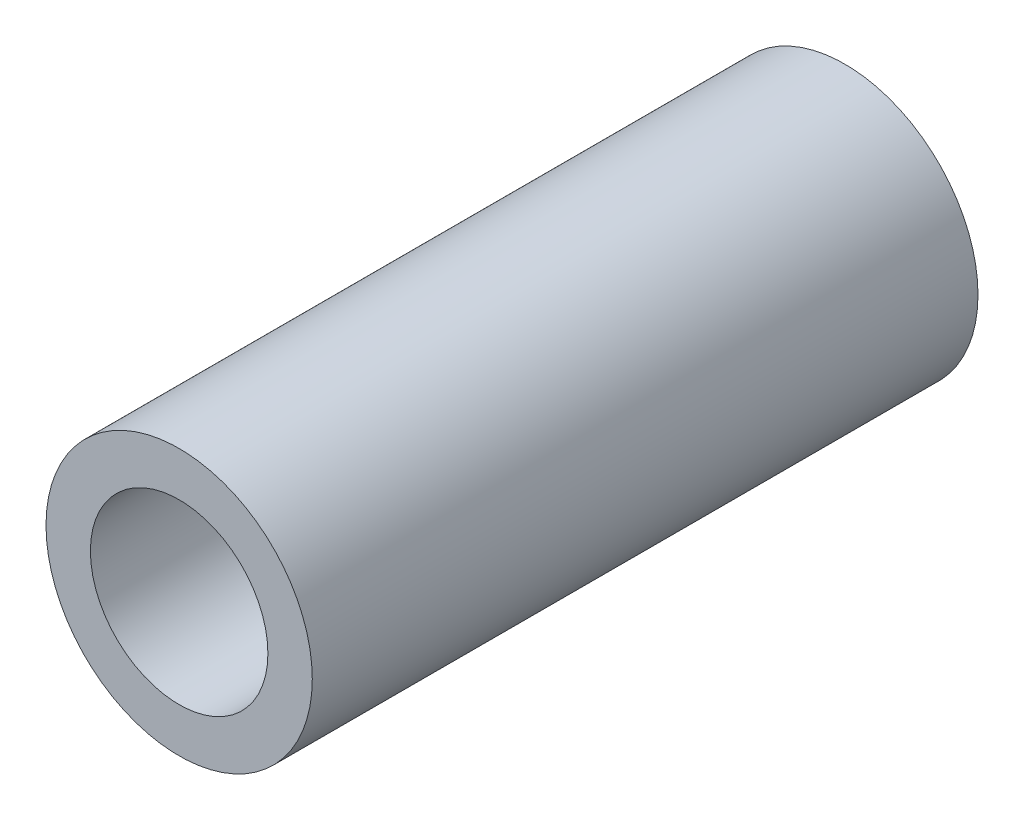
ISO-10303-21;
HEADER;
FILE_DESCRIPTION(('STEP AP214'),'2;1');
FILE_NAME('part.step','',(''),(''),'','','');
FILE_SCHEMA(('AUTOMOTIVE_DESIGN { 1 0 10303 214 1 1 1 1 }'));
ENDSEC;
DATA;
#1=APPLICATION_CONTEXT('core data for automotive mechanical design processes');
#2=APPLICATION_PROTOCOL_DEFINITION('international standard','automotive_design',2000,#1);
#3=PRODUCT_CONTEXT('',#1,'mechanical');
#4=PRODUCT('Part','Part','',(#3));
#5=PRODUCT_RELATED_PRODUCT_CATEGORY('part','',(#4));
#6=PRODUCT_DEFINITION_FORMATION('','',#4);
#7=PRODUCT_DEFINITION_CONTEXT('part definition',#1,'design');
#8=PRODUCT_DEFINITION('design','',#6,#7);
#9=PRODUCT_DEFINITION_SHAPE('','',#8);
#10=(LENGTH_UNIT() NAMED_UNIT(*) SI_UNIT(.MILLI.,.METRE.));
#11=(NAMED_UNIT(*) PLANE_ANGLE_UNIT() SI_UNIT($,.RADIAN.));
#12=(NAMED_UNIT(*) SI_UNIT($,.STERADIAN.) SOLID_ANGLE_UNIT());
#13=UNCERTAINTY_MEASURE_WITH_UNIT(LENGTH_MEASURE(1.E-05),#10,'distance_accuracy_value','');
#14=(GEOMETRIC_REPRESENTATION_CONTEXT(3) GLOBAL_UNCERTAINTY_ASSIGNED_CONTEXT((#13)) GLOBAL_UNIT_ASSIGNED_CONTEXT((#10,
#11,#12)) REPRESENTATION_CONTEXT('',''));
#15=CARTESIAN_POINT('',(0.,0.,0.));
#16=DIRECTION('',(0.,0.,1.));
#17=DIRECTION('',(1.,0.,0.));
#18=AXIS2_PLACEMENT_3D('',#15,#16,#17);
#19=CARTESIAN_POINT('',(0.,0.,15.));
#20=DIRECTION('',(0.,0.,1.));
#21=DIRECTION('',(1.,0.,0.));
#22=AXIS2_PLACEMENT_3D('',#19,#20,#21);
#23=PLANE('',#22);
#24=CARTESIAN_POINT('',(0.,0.,15.));
#25=DIRECTION('',(0.,0.,1.));
#26=DIRECTION('',(1.,0.,0.));
#27=AXIS2_PLACEMENT_3D('',#24,#25,#26);
#28=CIRCLE('',#27,3.);
#29=CARTESIAN_POINT('',(3.,0.,15.));
#30=VERTEX_POINT('',#29);
#31=EDGE_CURVE('E10',#30,#30,#28,.T.);
#32=ORIENTED_EDGE('',*,*,#31,.T.);
#33=EDGE_LOOP('',(#32));
#34=FACE_BOUND('',#33,.T.);
#35=CARTESIAN_POINT('',(0.,0.,15.));
#36=DIRECTION('',(0.,0.,1.));
#37=DIRECTION('',(1.,0.,0.));
#38=AXIS2_PLACEMENT_3D('',#35,#36,#37);
#39=CIRCLE('',#38,2.);
#40=CARTESIAN_POINT('',(2.,0.,15.));
#41=VERTEX_POINT('',#40);
#42=EDGE_CURVE('E41',#41,#41,#39,.T.);
#43=ORIENTED_EDGE('',*,*,#42,.F.);
#44=EDGE_LOOP('',(#43));
#45=FACE_BOUND('',#44,.T.);
#46=ADVANCED_FACE('F30',(#34,#45),#23,.T.);
#47=CARTESIAN_POINT('',(0.,0.,0.));
#48=DIRECTION('',(0.,0.,1.));
#49=DIRECTION('',(1.,0.,0.));
#50=AXIS2_PLACEMENT_3D('',#47,#48,#49);
#51=PLANE('',#50);
#52=CARTESIAN_POINT('',(0.,0.,0.));
#53=DIRECTION('',(0.,0.,1.));
#54=DIRECTION('',(1.,0.,0.));
#55=AXIS2_PLACEMENT_3D('',#52,#53,#54);
#56=CIRCLE('',#55,3.);
#57=CARTESIAN_POINT('',(3.,0.,0.));
#58=VERTEX_POINT('',#57);
#59=EDGE_CURVE('E37',#58,#58,#56,.T.);
#60=ORIENTED_EDGE('',*,*,#59,.F.);
#61=EDGE_LOOP('',(#60));
#62=FACE_BOUND('',#61,.T.);
#63=CARTESIAN_POINT('',(0.,0.,0.));
#64=DIRECTION('',(0.,0.,1.));
#65=DIRECTION('',(1.,0.,0.));
#66=AXIS2_PLACEMENT_3D('',#63,#64,#65);
#67=CIRCLE('',#66,2.);
#68=CARTESIAN_POINT('',(2.,0.,0.));
#69=VERTEX_POINT('',#68);
#70=EDGE_CURVE('E45',#69,#69,#67,.T.);
#71=ORIENTED_EDGE('',*,*,#70,.T.);
#72=EDGE_LOOP('',(#71));
#73=FACE_BOUND('',#72,.T.);
#74=ADVANCED_FACE('F51',(#62,#73),#51,.F.);
#75=CARTESIAN_POINT('',(0.,0.,15.));
#76=DIRECTION('',(0.,0.,-1.));
#77=DIRECTION('',(-1.,0.,0.));
#78=AXIS2_PLACEMENT_3D('',#75,#76,#77);
#79=CYLINDRICAL_SURFACE('',#78,3.);
#80=ORIENTED_EDGE('',*,*,#31,.F.);
#81=EDGE_LOOP('',(#80));
#82=FACE_BOUND('',#81,.T.);
#83=ORIENTED_EDGE('',*,*,#59,.T.);
#84=EDGE_LOOP('',(#83));
#85=FACE_BOUND('',#84,.T.);
#86=ADVANCED_FACE('F32',(#82,#85),#79,.T.);
#87=CARTESIAN_POINT('',(0.,0.,15.));
#88=DIRECTION('',(0.,0.,-1.));
#89=DIRECTION('',(-1.,0.,0.));
#90=AXIS2_PLACEMENT_3D('',#87,#88,#89);
#91=CYLINDRICAL_SURFACE('',#90,2.);
#92=ORIENTED_EDGE('',*,*,#42,.T.);
#93=EDGE_LOOP('',(#92));
#94=FACE_BOUND('',#93,.T.);
#95=ORIENTED_EDGE('',*,*,#70,.F.);
#96=EDGE_LOOP('',(#95));
#97=FACE_BOUND('',#96,.T.);
#98=ADVANCED_FACE('F53',(#94,#97),#91,.F.);
#99=CLOSED_SHELL('',(#46,#74,#86,#98));
#100=MANIFOLD_SOLID_BREP('B2',#99);
#101=ADVANCED_BREP_SHAPE_REPRESENTATION('',(#18,#100),#14);
#102=SHAPE_DEFINITION_REPRESENTATION(#9,#101);
ENDSEC;
END-ISO-10303-21;
